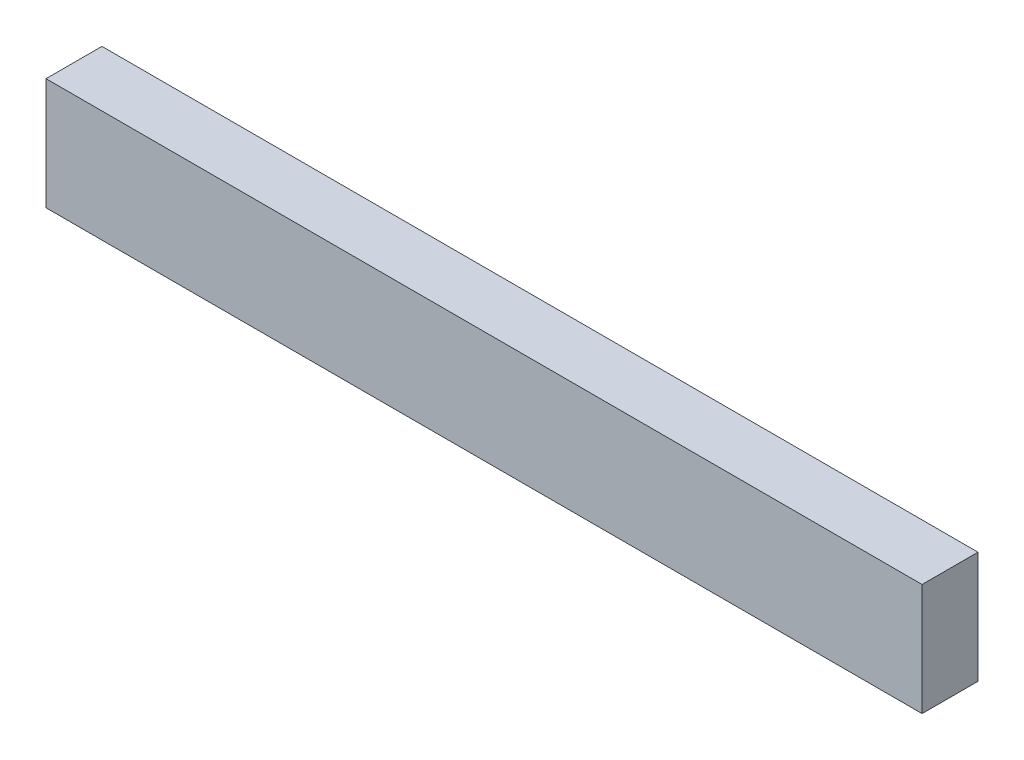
ISO-10303-21;
HEADER;
FILE_DESCRIPTION(('STEP AP214'),'2;1');
FILE_NAME('part.step','',(''),(''),'','','');
FILE_SCHEMA(('AUTOMOTIVE_DESIGN { 1 0 10303 214 1 1 1 1 }'));
ENDSEC;
DATA;
#1=APPLICATION_CONTEXT('core data for automotive mechanical design processes');
#2=APPLICATION_PROTOCOL_DEFINITION('international standard','automotive_design',2000,#1);
#3=PRODUCT_CONTEXT('',#1,'mechanical');
#4=PRODUCT('Part','Part','',(#3));
#5=PRODUCT_RELATED_PRODUCT_CATEGORY('part','',(#4));
#6=PRODUCT_DEFINITION_FORMATION('','',#4);
#7=PRODUCT_DEFINITION_CONTEXT('part definition',#1,'design');
#8=PRODUCT_DEFINITION('design','',#6,#7);
#9=PRODUCT_DEFINITION_SHAPE('','',#8);
#10=(LENGTH_UNIT() NAMED_UNIT(*) SI_UNIT(.MILLI.,.METRE.));
#11=(NAMED_UNIT(*) PLANE_ANGLE_UNIT() SI_UNIT($,.RADIAN.));
#12=(NAMED_UNIT(*) SI_UNIT($,.STERADIAN.) SOLID_ANGLE_UNIT());
#13=UNCERTAINTY_MEASURE_WITH_UNIT(LENGTH_MEASURE(1.E-05),#10,'distance_accuracy_value','');
#14=(GEOMETRIC_REPRESENTATION_CONTEXT(3) GLOBAL_UNCERTAINTY_ASSIGNED_CONTEXT((#13)) GLOBAL_UNIT_ASSIGNED_CONTEXT((#10,
#11,#12)) REPRESENTATION_CONTEXT('',''));
#15=CARTESIAN_POINT('',(0.,0.,0.));
#16=DIRECTION('',(0.,0.,1.));
#17=DIRECTION('',(1.,0.,0.));
#18=AXIS2_PLACEMENT_3D('',#15,#16,#17);
#19=CARTESIAN_POINT('',(298.45,0.,0.));
#20=DIRECTION('',(0.,0.,-1.));
#21=DIRECTION('',(-1.,0.,0.));
#22=AXIS2_PLACEMENT_3D('',#19,#20,#21);
#23=PLANE('',#22);
#24=DIRECTION('',(0.,-1.,0.));
#25=VECTOR('',#24,1.);
#26=CARTESIAN_POINT('',(0.,0.,0.));
#27=LINE('',#26,#25);
#28=CARTESIAN_POINT('',(0.,38.1,0.));
#29=VERTEX_POINT('',#28);
#30=CARTESIAN_POINT('',(0.,0.,0.));
#31=VERTEX_POINT('',#30);
#32=EDGE_CURVE('E93',#29,#31,#27,.T.);
#33=ORIENTED_EDGE('',*,*,#32,.T.);
#34=DIRECTION('',(-1.,0.,0.));
#35=VECTOR('',#34,1.);
#36=CARTESIAN_POINT('',(298.45,0.,0.));
#37=LINE('',#36,#35);
#38=CARTESIAN_POINT('',(298.45,0.,0.));
#39=VERTEX_POINT('',#38);
#40=EDGE_CURVE('E11',#39,#31,#37,.T.);
#41=ORIENTED_EDGE('',*,*,#40,.F.);
#42=DIRECTION('',(0.,-1.,0.));
#43=VECTOR('',#42,1.);
#44=CARTESIAN_POINT('',(298.45,0.,0.));
#45=LINE('',#44,#43);
#46=CARTESIAN_POINT('',(298.45,38.1,0.));
#47=VERTEX_POINT('',#46);
#48=EDGE_CURVE('E81',#47,#39,#45,.T.);
#49=ORIENTED_EDGE('',*,*,#48,.F.);
#50=DIRECTION('',(-1.,0.,0.));
#51=VECTOR('',#50,1.);
#52=CARTESIAN_POINT('',(298.45,38.1,0.));
#53=LINE('',#52,#51);
#54=EDGE_CURVE('E89',#47,#29,#53,.T.);
#55=ORIENTED_EDGE('',*,*,#54,.T.);
#56=EDGE_LOOP('',(#33,#41,#49,#55));
#57=FACE_BOUND('',#56,.T.);
#58=ADVANCED_FACE('F30',(#57),#23,.F.);
#59=CARTESIAN_POINT('',(298.45,0.,0.));
#60=DIRECTION('',(0.,1.,0.));
#61=DIRECTION('',(0.,0.,1.));
#62=AXIS2_PLACEMENT_3D('',#59,#60,#61);
#63=PLANE('',#62);
#64=DIRECTION('',(0.,0.,-1.));
#65=VECTOR('',#64,1.);
#66=CARTESIAN_POINT('',(0.,0.,0.));
#67=LINE('',#66,#65);
#68=CARTESIAN_POINT('',(0.,0.,-19.05));
#69=VERTEX_POINT('',#68);
#70=EDGE_CURVE('E85',#31,#69,#67,.T.);
#71=ORIENTED_EDGE('',*,*,#70,.T.);
#72=DIRECTION('',(-1.,0.,0.));
#73=VECTOR('',#72,1.);
#74=CARTESIAN_POINT('',(298.45,0.,-19.05));
#75=LINE('',#74,#73);
#76=CARTESIAN_POINT('',(298.45,0.,-19.05));
#77=VERTEX_POINT('',#76);
#78=EDGE_CURVE('E38',#77,#69,#75,.T.);
#79=ORIENTED_EDGE('',*,*,#78,.F.);
#80=DIRECTION('',(0.,0.,-1.));
#81=VECTOR('',#80,1.);
#82=CARTESIAN_POINT('',(298.45,0.,0.));
#83=LINE('',#82,#81);
#84=EDGE_CURVE('E76',#39,#77,#83,.T.);
#85=ORIENTED_EDGE('',*,*,#84,.F.);
#86=ORIENTED_EDGE('',*,*,#40,.T.);
#87=EDGE_LOOP('',(#71,#79,#85,#86));
#88=FACE_BOUND('',#87,.T.);
#89=ADVANCED_FACE('F84',(#88),#63,.F.);
#90=CARTESIAN_POINT('',(298.45,0.,-19.05));
#91=DIRECTION('',(0.,0.,1.));
#92=DIRECTION('',(1.,0.,0.));
#93=AXIS2_PLACEMENT_3D('',#90,#91,#92);
#94=PLANE('',#93);
#95=DIRECTION('',(0.,1.,0.));
#96=VECTOR('',#95,1.);
#97=CARTESIAN_POINT('',(0.,0.,-19.05));
#98=LINE('',#97,#96);
#99=CARTESIAN_POINT('',(0.,38.1,-19.05));
#100=VERTEX_POINT('',#99);
#101=EDGE_CURVE('E63',#69,#100,#98,.T.);
#102=ORIENTED_EDGE('',*,*,#101,.T.);
#103=DIRECTION('',(-1.,0.,0.));
#104=VECTOR('',#103,1.);
#105=CARTESIAN_POINT('',(298.45,38.1,-19.05));
#106=LINE('',#105,#104);
#107=CARTESIAN_POINT('',(298.45,38.1,-19.05));
#108=VERTEX_POINT('',#107);
#109=EDGE_CURVE('E86',#108,#100,#106,.T.);
#110=ORIENTED_EDGE('',*,*,#109,.F.);
#111=DIRECTION('',(0.,1.,0.));
#112=VECTOR('',#111,1.);
#113=CARTESIAN_POINT('',(298.45,0.,-19.05));
#114=LINE('',#113,#112);
#115=EDGE_CURVE('E79',#77,#108,#114,.T.);
#116=ORIENTED_EDGE('',*,*,#115,.F.);
#117=ORIENTED_EDGE('',*,*,#78,.T.);
#118=EDGE_LOOP('',(#102,#110,#116,#117));
#119=FACE_BOUND('',#118,.T.);
#120=ADVANCED_FACE('F87',(#119),#94,.F.);
#121=CARTESIAN_POINT('',(298.45,38.1,0.));
#122=DIRECTION('',(0.,-1.,0.));
#123=DIRECTION('',(0.,0.,-1.));
#124=AXIS2_PLACEMENT_3D('',#121,#122,#123);
#125=PLANE('',#124);
#126=DIRECTION('',(0.,0.,1.));
#127=VECTOR('',#126,1.);
#128=CARTESIAN_POINT('',(0.,38.1,0.));
#129=LINE('',#128,#127);
#130=EDGE_CURVE('E69',#100,#29,#129,.T.);
#131=ORIENTED_EDGE('',*,*,#130,.T.);
#132=ORIENTED_EDGE('',*,*,#54,.F.);
#133=DIRECTION('',(0.,0.,1.));
#134=VECTOR('',#133,1.);
#135=CARTESIAN_POINT('',(298.45,38.1,0.));
#136=LINE('',#135,#134);
#137=EDGE_CURVE('E46',#108,#47,#136,.T.);
#138=ORIENTED_EDGE('',*,*,#137,.F.);
#139=ORIENTED_EDGE('',*,*,#109,.T.);
#140=EDGE_LOOP('',(#131,#132,#138,#139));
#141=FACE_BOUND('',#140,.T.);
#142=ADVANCED_FACE('F100',(#141),#125,.F.);
#143=CARTESIAN_POINT('',(298.45,38.1,0.));
#144=DIRECTION('',(-1.,0.,0.));
#145=DIRECTION('',(0.,0.,1.));
#146=AXIS2_PLACEMENT_3D('',#143,#144,#145);
#147=PLANE('',#146);
#148=ORIENTED_EDGE('',*,*,#48,.T.);
#149=ORIENTED_EDGE('',*,*,#84,.T.);
#150=ORIENTED_EDGE('',*,*,#115,.T.);
#151=ORIENTED_EDGE('',*,*,#137,.T.);
#152=EDGE_LOOP('',(#148,#149,#150,#151));
#153=FACE_BOUND('',#152,.T.);
#154=ADVANCED_FACE('F77',(#153),#147,.F.);
#155=CARTESIAN_POINT('',(0.,38.1,0.));
#156=DIRECTION('',(-1.,0.,0.));
#157=DIRECTION('',(0.,0.,1.));
#158=AXIS2_PLACEMENT_3D('',#155,#156,#157);
#159=PLANE('',#158);
#160=ORIENTED_EDGE('',*,*,#32,.F.);
#161=ORIENTED_EDGE('',*,*,#130,.F.);
#162=ORIENTED_EDGE('',*,*,#101,.F.);
#163=ORIENTED_EDGE('',*,*,#70,.F.);
#164=EDGE_LOOP('',(#160,#161,#162,#163));
#165=FACE_BOUND('',#164,.T.);
#166=ADVANCED_FACE('F103',(#165),#159,.T.);
#167=CLOSED_SHELL('',(#58,#89,#120,#142,#154,#166));
#168=MANIFOLD_SOLID_BREP('B2',#167);
#169=ADVANCED_BREP_SHAPE_REPRESENTATION('',(#18,#168),#14);
#170=SHAPE_DEFINITION_REPRESENTATION(#9,#169);
ENDSEC;
END-ISO-10303-21;
